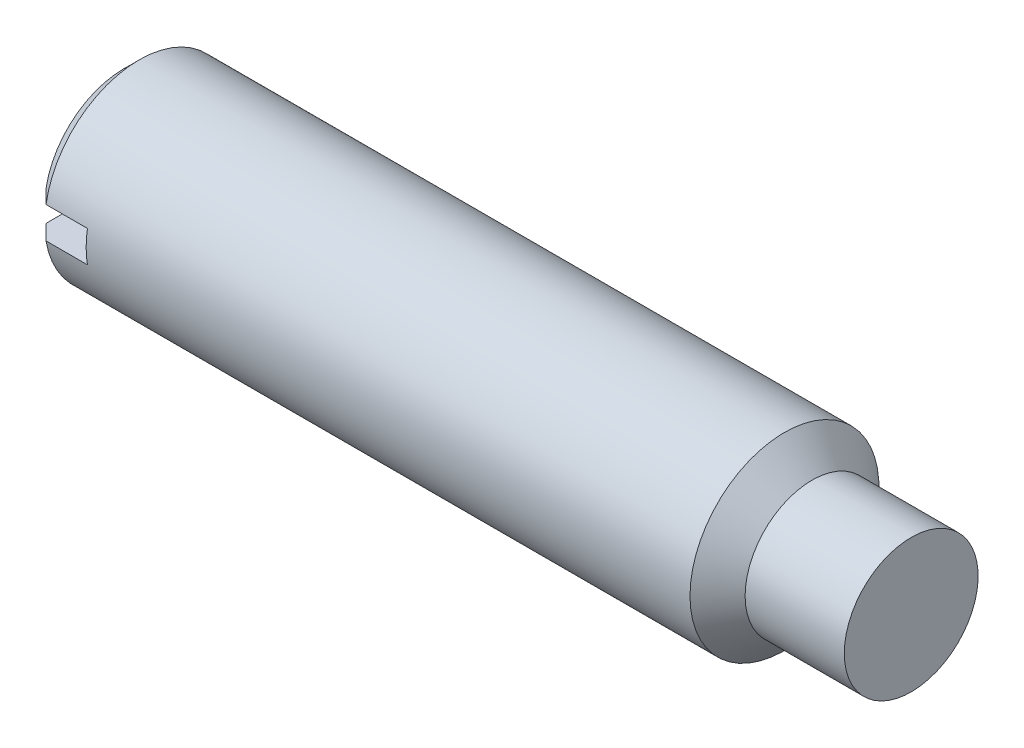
from build123d import *

# Parameters (mm, degrees)
SLOTSKE_W  = 12
SLOTSKE_H  = 2
SLOT_DEPTH = 3.6


with BuildPart() as part:
    # BodySke → BaseBody (revolve)
    with BuildSketch(Plane.XY, mode=Mode.PRIVATE) as basebody_sk:
        Polygon((0, 0), (0, 5.036), (0.964, 6), (41.95, 6), (43.7, 4.25), (50, 4.25), (50, 0), align=None)
    revolve(basebody_sk.sketch.rotate(Axis((0, 0, 0), (1, 0, 0)), 90), axis=Axis((0, 0, 0), (1, 0, 0)))

    # SlotSke → Slot (cut)
    with BuildSketch(Plane(origin=(0, 0, 0), x_dir=(0, 0, -1), z_dir=(1, 0, 0))):
        Rectangle(SLOTSKE_W, SLOTSKE_H)
    extrude(amount=SLOT_DEPTH, mode=Mode.SUBTRACT)


solid = part.part
